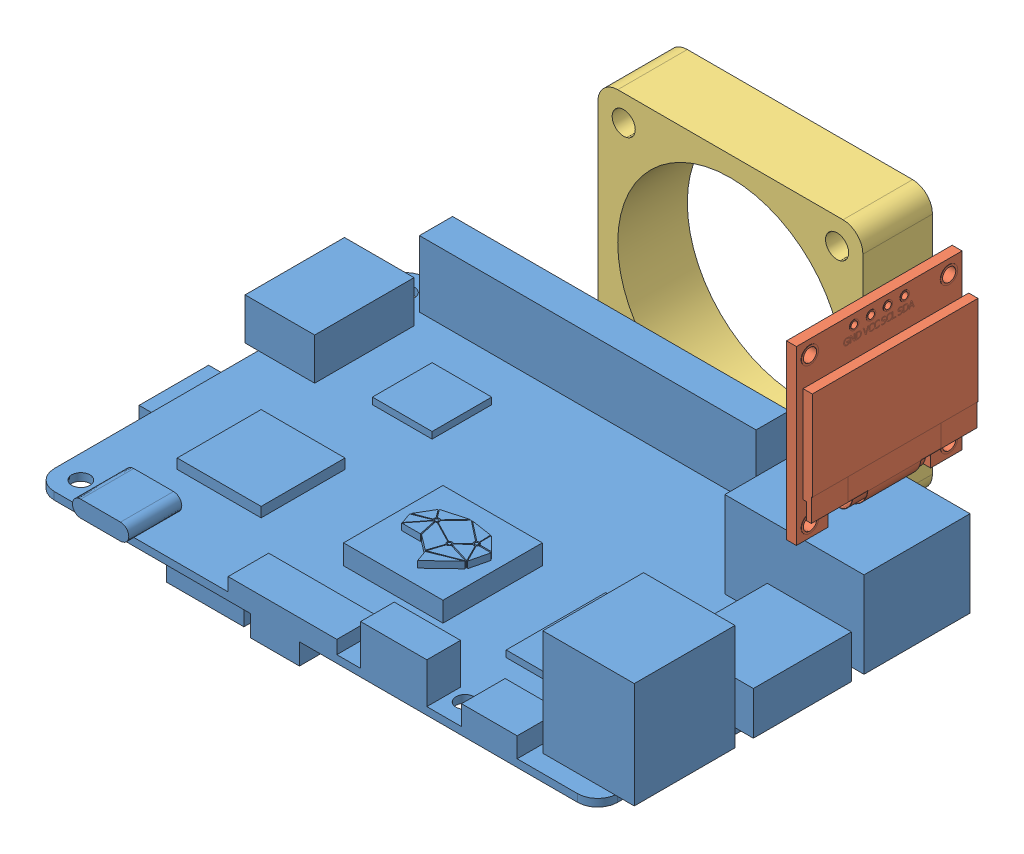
SolidWorks assembly 装配体1.1.SLDASM, configuration 默认 (file format 14000). Lengths in mm.
Overall size (91 69 74.5).
10 component instances, 8 part files, 20 mates.
Components (placement in the parent):
- 旭日X3派-1: 旭日X3派.SLDPRT [默认] at (5.3708 3.1383 90.25) size (91 20.32 57.5)
- 外壳1.1-1: 外壳1.1.SLDPRT [默认] at (-37.1292 -6.8617 118.25) size (90 69 71)
- 0.96OLED-1: 0.96OLED.SLDPRT [默认] at (47.7208 34.8683 75.75) x (0 0 -1) z (1 0 0) size (25 26 5.1)
- 风扇-1: 风扇.SLDPRT [默认] at (-12.5953 -1.1925 47.25) size (40 40 10.5)
- 侧板（type-c）-1: 侧板（type-c）.SLDPRT [默认] at (-39.1292 60.1383 119.1724) size (89 69 2)
- 侧板（风扇）-1: 侧板（风扇）.SLDPRT [默认] at (-39.1292 60.1383 47.25) size (89 69 2)
- 28散热片-1: 28散热片.SLDPRT [默认] at (16.9095 36.2783 108.1958) x (-1 0 0) z (0 -1 0) size (28 28 28)
- 10散热片-1: 10散热片.SLDPRT [默认] at (-21.5242 15.2783 72.9477) x (1 0 0) z (0 -1 0) size (10 10 10)
- 10散热片-2: 10散热片.SLDPRT [默认] at (21.9158 15.2783 93.0883) x (1 0 0) z (0 -1 0) size (10 10 10)
- 10散热片-3: 10散热片.SLDPRT [默认] at (-26.57 15.7783 94.6576) x (1 0 0) z (0 -1 0) size (10 10 10)
Mates (geometry in assembly coordinates):
- 距离1: distance = 10 mm anti-aligned: plane of 外壳1.1-1 through (-29.1292 -6.8617 47.25) normal (0 1 0); plane of 旭日X3派-1 through (5.3708 3.1383 90.25) normal (0 -1 0)
- 重合2: coincident aligned: plane of 旭日X3派-1 through (-37.1292 4.2783 118.25) normal (0 0 1); plane of 外壳1.1-1 through (-29.1292 50.1383 118.25) normal (0 0 1)
- 重合3: coincident anti-aligned: plane of 旭日X3派-1 through (-37.1292 4.2783 118.25) normal (-1 0 0); plane of 外壳1.1-1 through (-37.1292 1.1383 47.25) normal (1 0 0)
- 重合5: coincident anti-aligned: plane of 外壳1.1-1 through (47.8708 1.1383 47.25) normal (-1 0 0); plane of 0.96OLED-1 through (47.8708 36.0314 75.75) normal (1 0 0)
- 平行3: parallel aligned: plane of 外壳1.1-1 through (-29.1292 50.1383 47.25) normal (0 0 -1); plane of 0.96OLED-1 through (46.3708 23.2183 63.25) normal (0 0 -1)
- 平行4: parallel anti-aligned: plane of 外壳1.1-1 through (-29.1292 58.1383 47.25) normal (0 -1 0); plane of 0.96OLED-1 through (46.3708 49.2183 63.25) normal (0 1 0)
- 同心1: concentric anti-aligned: circle of 外壳1.1-1; circle of 0.96OLED-1
- 重合10: coincident aligned: plane of 外壳1.1-1 through (-29.1292 50.1383 47.25) normal (0 0 -1); plane of 风扇-1 through (24.4047 1.8075 47.25) normal (0 0 -1)
- 平行7: parallel aligned: plane of 外壳1.1-1 through (-39.1292 1.1383 47.25) normal (-1 0 0); plane of 风扇-1 through (-12.5953 1.8075 57.75) normal (-1 0 0)
- 重合14: coincident aligned: plane of 外壳1.1-1 through (-39.1292 1.1383 47.25) normal (-1 0 0); plane of 侧板（type-c）-1 through (-39.1292 60.1383 117.1724) normal (-1 0 0)
- 重合15: coincident aligned: plane of 外壳1.1-1 through (-29.1292 60.1383 47.25) normal (0 1 0); plane of 侧板（type-c）-1 through (-39.1292 60.1383 117.1724) normal (0 1 0)
- 重合16: coincident anti-aligned: plane of 外壳1.1-1 through (-29.1292 50.1383 47.25) normal (0 0 -1); plane of 侧板（风扇）-1 through (-39.1292 60.1383 47.25) normal (0 0 1)
- 同心2: concentric aligned: circle of 外壳1.1-1; circle of 侧板（风扇）-1
- 重合17: coincident: plane of 外壳1.1-1 through (-29.1292 60.1383 47.25) normal (0 1 0); line of 侧板（风扇）-1 through (-29.1292 60.1383 47.25) axis (1 0 0)
- 同心4: concentric anti-aligned: circle of 风扇-1; circle of 侧板（风扇）-1
- 重合20: coincident anti-aligned: plane of 旭日X3派-1 through (5.3708 8.2783 90.25) normal (0 1 0); plane of 28散热片-1 through (16.9095 8.2783 80.1958) normal (0 -1 0)
- 平行8: parallel aligned: plane of 旭日X3派-1 through (12.4108 7.2783 91.13) normal (1 0 0); plane of 28散热片-1 through (16.9095 36.2783 80.1958) normal (1 0 0)
- 重合22: coincident anti-aligned: plane of 旭日X3派-1 through (5.3708 5.2783 90.25) normal (0 1 0); plane of 10散热片-2 through (21.9158 5.2783 103.0883) normal (0 -1 0)
- 重合23: coincident anti-aligned: plane of 旭日X3派-1 through (5.3708 5.7783 90.25) normal (0 1 0); plane of 10散热片-3 through (-26.57 5.7783 104.6576) normal (0 -1 0)
- 重合24: coincident anti-aligned: plane of 旭日X3派-1 through (5.3708 5.2783 90.25) normal (0 1 0); plane of 10散热片-1 through (-21.5242 5.2783 82.9477) normal (0 -1 0)
